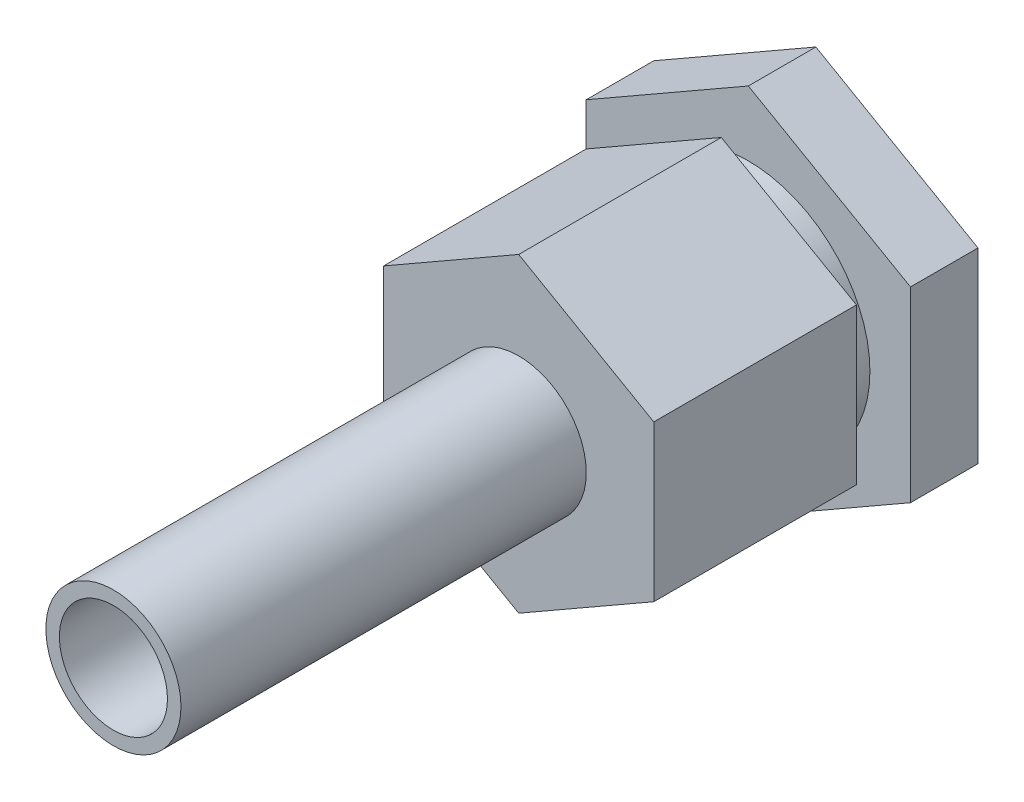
from build123d import *

# Parameters (mm, degrees)
ESQUISSE1_R        = 8
EXTRUSION1_DEPTH   = 5
EXTRUSION2_START   = -2
ESQUISSE2_R        = 9
EXTRUSION2_DEPTH   = 9
EXTRUSION3_DEPTH   = 15
ESQUISSE4_R        = 5
ESQUISSE4_R_2      = 4
EXTRU_MINCE1_DEPTH = 30


with BuildPart() as part:
    # Esquisse1 → Extrusion1 (new body)
    with BuildSketch(Plane.XY):
        Polygon((0, 13.8), (12, 6.916944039), (12, -6.916944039), (0, -13.8), (-12, -6.916944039), (-12, 6.916944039), align=None)
        Circle(ESQUISSE1_R, mode=Mode.SUBTRACT)
    extrude(amount=EXTRUSION1_DEPTH)

    # Esquisse2 → Extrusion2 (add)
    with BuildSketch(Plane.XY.offset(EXTRUSION2_START)):
        Circle(ESQUISSE2_R)
    extrude(amount=EXTRUSION2_DEPTH)

    # Esquisse3 → Extrusion3 (add)
    with BuildSketch(Plane.XY.offset(7)):
        Polygon((0, 11.5), (10, 5.764120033), (10, -5.764120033), (0, -11.5), (-10, -5.764120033), (-10, 5.764120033), align=None)
    extrude(amount=EXTRUSION3_DEPTH)

    # Esquisse4 → Extru.-Mince1 (add)
    with BuildSketch(Plane.XY.offset(22)):
        Circle(ESQUISSE4_R)
        Circle(ESQUISSE4_R_2, mode=Mode.SUBTRACT)
    extrude(amount=EXTRU_MINCE1_DEPTH)


solid = part.part
